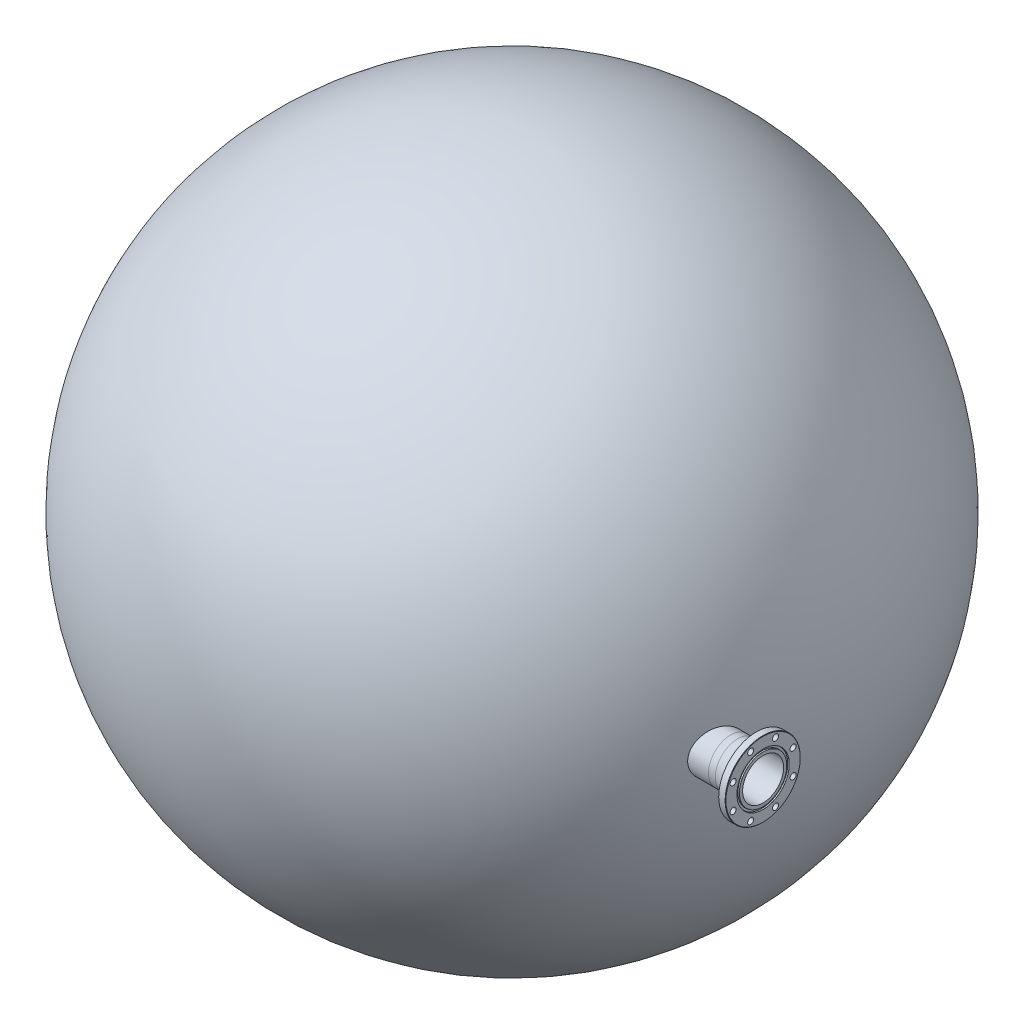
from build123d import *

# Parameters (mm, degrees)
CIRPATTERN1_COUNT        = 8
CHAMFER1_SIZE            = 1.5875
FILLET1_R                = 9.525
BOSS_EXTRUDE1_REACH      = 3170.408
BOSS_EXTRUDE1_END_RADIUS = 1225.55
SKETCH6_R                = 82.55
SKETCH6_R_2              = 76.2


with BuildPart() as part:
    # Sketch1 → Revolve1 (revolve)
    with BuildSketch(Plane(origin=(0, 0, 0), x_dir=(1, 0, 0), z_dir=(0, 1, 0)), mode=Mode.PRIVATE) as revolve1_sk:
        with BuildLine():
            Line((0, 76.2), (120.65, 76.2))
            Line((120.65, 76.2), (120.65, 88.019461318))
            ThreePointArc((120.65, 88.019461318), (120.616634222, 88.105261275), (120.534068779, 88.145978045))
            Line((120.534068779, 88.145978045), (115.660531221, 88.572357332))
            ThreePointArc((115.660531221, 88.572357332), (115.577965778, 88.613074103), (115.5446, 88.698874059))
            Line((115.5446, 88.698874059), (115.5446, 96.644925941))
            ThreePointArc((115.5446, 96.644925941), (115.577965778, 96.730725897), (115.660531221, 96.771442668))
            Line((115.660531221, 96.771442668), (120.534068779, 97.197821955))
            ThreePointArc((120.534068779, 97.197821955), (120.616634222, 97.238538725), (120.65, 97.324338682))
            Line((120.65, 97.324338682), (120.65, 139.7))
            Line((120.65, 139.7), (95.25, 139.7))
            Line((95.25, 139.7), (95.25, 95.25))
            Line((95.25, 95.25), (25.4, 82.55))
            Line((25.4, 82.55), (0, 82.55))
            Line((0, 82.55), (0, 76.2))
        make_face()
    revolve(revolve1_sk.sketch.rotate(Axis((0, 0, 0), (1, 0, 0)), 180), axis=Axis((0, 0, 0), (1, 0, 0)))

    # Sketch4 → 7_8 _0.875_ Diameter Hole1 (revolve, cut)
    with BuildSketch(Plane(origin=(120.65, 46.170756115, 111.466065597), x_dir=(0, 0, -1), z_dir=(0, 1, 0))):
        Polygon((0, 0), (0, 82.877063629), (11.1125, 76.2), (11.1125, 0), align=None)
    f_7_8_0_875_diameter_hole1 = revolve(axis=Axis((127, 46.170756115, 111.466065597), (-1, 0, 0)), mode=Mode.SUBTRACT)

    # CirPattern1: 7_8 _0.875_ Diameter Hole1 ×8 about axis
    cirpattern1_axis = Axis((0, 0, 0), (1, 0, 0))
    for i in range(1, CIRPATTERN1_COUNT):
        add(f_7_8_0_875_diameter_hole1.rotate(cirpattern1_axis, i * 360 / CIRPATTERN1_COUNT), mode=Mode.SUBTRACT)

    # Chamfer1
    chamfer1_edges = [part.edges().sort_by_distance(p)[0] for p in [
        (120.65, 0, -139.7),
    ]]
    chamfer(chamfer1_edges, length=CHAMFER1_SIZE)

    # Fillet1
    fillet1_edges = [part.edges().sort_by_distance(p)[0] for p in [
        (95.25, 0, -95.25),
    ]]
    fillet(fillet1_edges, radius=FILLET1_R)


with BuildPart() as body_2:
    # Sketch2 → Revolve2 (revolve)
    with BuildSketch(Plane(origin=(0, 0, 0), x_dir=(1, 0, 0), z_dir=(0, 1, 0))):
        with BuildLine():
            Line((-2432.05, 393.7), (19.05, 393.7))
            ThreePointArc((19.05, 393.7), (-1206.5, -831.85), (-2432.05, 393.7))
        make_face()
    revolve(axis=Axis((-2432.05, 0, -393.7), (1, 0, 0)))


with BuildPart() as body_3:
    # Boss-Extrude1: up to this sphere (the profile starts outside it)
    boss_extrude1_end = Location((-1206.5, 0, -393.7)) * Sphere(BOSS_EXTRUDE1_END_RADIUS, mode=Mode.PRIVATE)
    # Sketch6 → Boss-Extrude1 (new, up to the surface)
    with BuildSketch(Plane.ZY, mode=Mode.PRIVATE) as boss_extrude1_sk1:
        with Locations(Location((0, 0, 0), (0, 0, 226.335624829))):
            Circle(SKETCH6_R)
        with Locations(Location((0, 0, 0), (0, 0, 226.269827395))):
            Circle(SKETCH6_R_2, mode=Mode.SUBTRACT)
    boss_extrude1_tool1 = extrude(boss_extrude1_sk1.sketch, amount=BOSS_EXTRUDE1_REACH, mode=Mode.PRIVATE) - boss_extrude1_end
    add(boss_extrude1_tool1.solids().sort_by_distance((0, 58.027353, 55.383156))[0])


solid = Compound([part.part, body_2.part, body_3.part])
